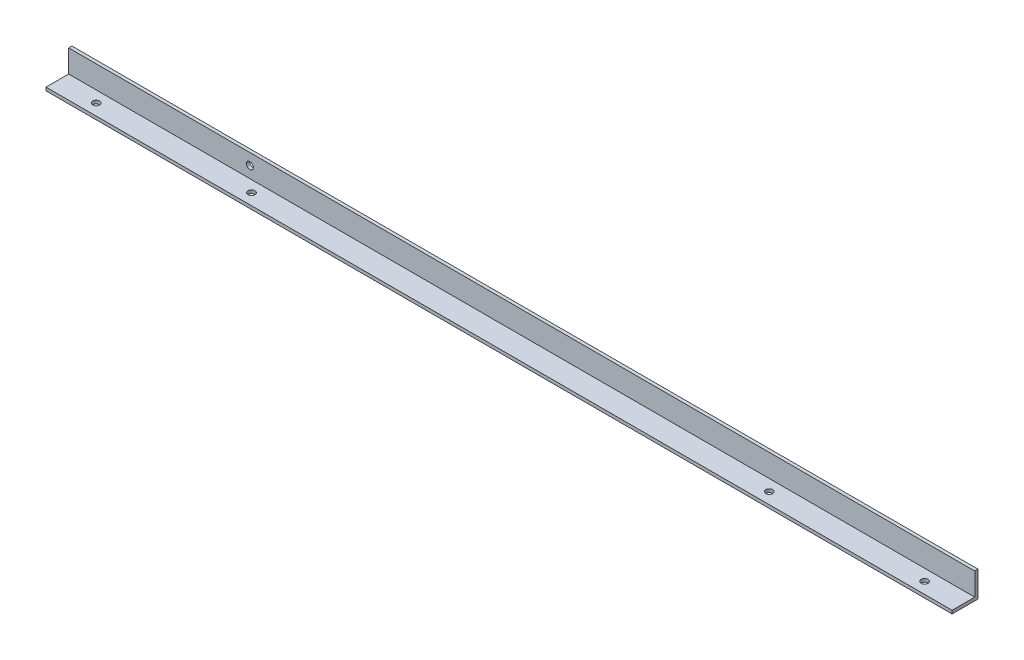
from build123d import *

# Parameters (mm, degrees)
SKETCH1_W           = 889
SKETCH1_H           = 25.4
BOSS_EXTRUDE1_DEPTH = 3.175
SKETCH2_W           = 889
SKETCH2_H           = 3.175
BOSS_EXTRUDE2_DEPTH = 22.225
SKETCH3_R           = 3.3782
CUT_EXTRUDE1_DEPTH  = 446.236443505
SKETCH4_R           = 3.3782
CUT_EXTRUDE2_DEPTH  = 446.779497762


with BuildPart() as part:
    # Sketch1 → Boss-Extrude1 (new body)
    with BuildSketch(Plane(origin=(0, 0, 0), x_dir=(1, 0, 0), z_dir=(0, 1, 0))):
        Rectangle(SKETCH1_W, SKETCH1_H)
    extrude(amount=BOSS_EXTRUDE1_DEPTH)

    # Sketch2 → Boss-Extrude2 (add)
    with BuildSketch(Plane(origin=(0, 3.175, 0), x_dir=(1, 0, 0), z_dir=(0, 1, 0))):
        with Locations((0, 11.1125)):
            Rectangle(SKETCH2_W, SKETCH2_H)
    extrude(amount=BOSS_EXTRUDE2_DEPTH)

    # Sketch3 → Cut-Extrude1 (cut, through all)
    with BuildSketch(Plane(origin=(0, 3.175, 0), x_dir=(1, 0, 0), z_dir=(0, 1, 0))):
        with Locations(Location((-406.4, -1.5875, 0), (0, 0, 270))):
            Circle(SKETCH3_R)
        with Locations(Location((-254, -1.5875, 0), (0, 0, 270))):
            Circle(SKETCH3_R)
        with Locations(Location((406.4, -1.5875, 0), (0, 0, 270))):
            Circle(SKETCH3_R)
        with Locations(Location((254, -1.5875, 0), (0, 0, 270))):
            Circle(SKETCH3_R)
    extrude(amount=-CUT_EXTRUDE1_DEPTH, mode=Mode.SUBTRACT)

    # Sketch4 → Cut-Extrude2 (cut, through all)
    with BuildSketch(Plane.XY.offset(-9.525)):
        with Locations((-266.7, 14.2875)):
            Circle(SKETCH4_R)
    extrude(amount=-CUT_EXTRUDE2_DEPTH, mode=Mode.SUBTRACT)


solid = part.part
